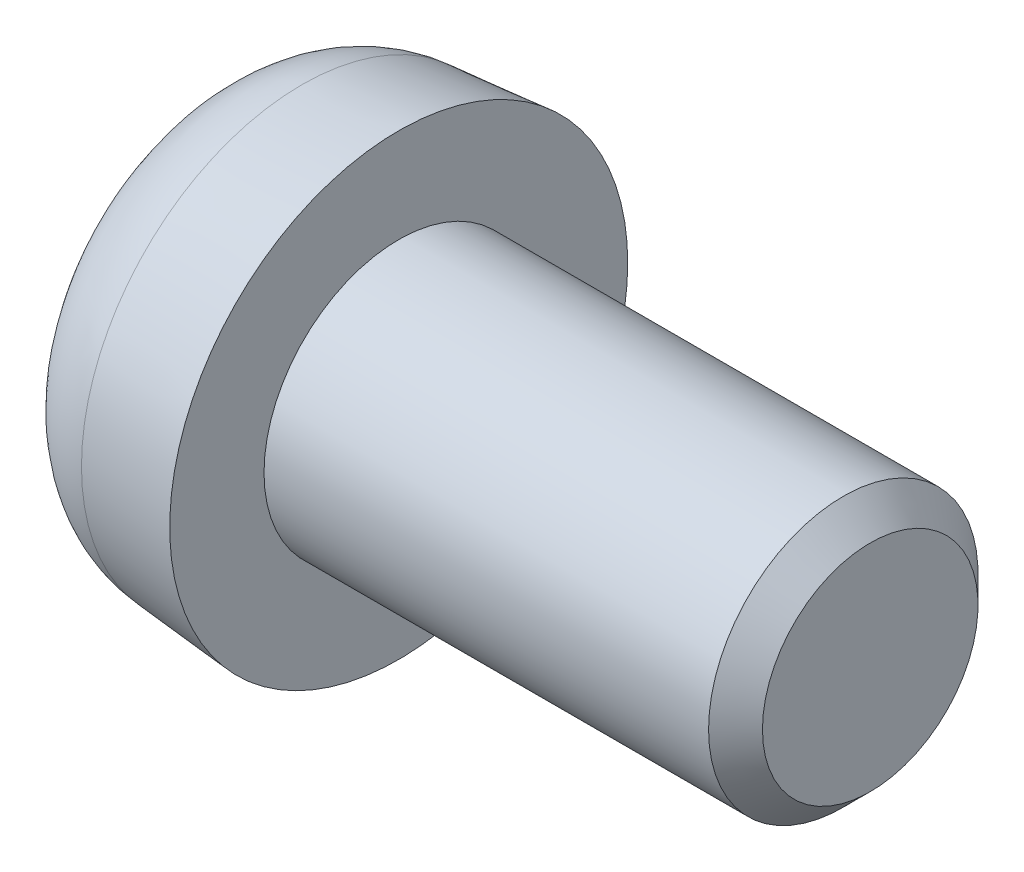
ISO-10303-21;
HEADER;
FILE_DESCRIPTION(('STEP AP214'),'2;1');
FILE_NAME('part.step','',(''),(''),'','','');
FILE_SCHEMA(('AUTOMOTIVE_DESIGN { 1 0 10303 214 1 1 1 1 }'));
ENDSEC;
DATA;
#1=APPLICATION_CONTEXT('core data for automotive mechanical design processes');
#2=APPLICATION_PROTOCOL_DEFINITION('international standard','automotive_design',2000,#1);
#3=PRODUCT_CONTEXT('',#1,'mechanical');
#4=PRODUCT('Part','Part','',(#3));
#5=PRODUCT_RELATED_PRODUCT_CATEGORY('part','',(#4));
#6=PRODUCT_DEFINITION_FORMATION('','',#4);
#7=PRODUCT_DEFINITION_CONTEXT('part definition',#1,'design');
#8=PRODUCT_DEFINITION('design','',#6,#7);
#9=PRODUCT_DEFINITION_SHAPE('','',#8);
#10=(LENGTH_UNIT() NAMED_UNIT(*) SI_UNIT(.MILLI.,.METRE.));
#11=(NAMED_UNIT(*) PLANE_ANGLE_UNIT() SI_UNIT($,.RADIAN.));
#12=(NAMED_UNIT(*) SI_UNIT($,.STERADIAN.) SOLID_ANGLE_UNIT());
#13=UNCERTAINTY_MEASURE_WITH_UNIT(LENGTH_MEASURE(1.E-05),#10,'distance_accuracy_value','');
#14=(GEOMETRIC_REPRESENTATION_CONTEXT(3) GLOBAL_UNCERTAINTY_ASSIGNED_CONTEXT((#13)) GLOBAL_UNIT_ASSIGNED_CONTEXT((#10,
#11,#12)) REPRESENTATION_CONTEXT('',''));
#15=CARTESIAN_POINT('',(0.,0.,0.));
#16=DIRECTION('',(0.,0.,1.));
#17=DIRECTION('',(1.,0.,0.));
#18=AXIS2_PLACEMENT_3D('',#15,#16,#17);
#19=CARTESIAN_POINT('',(10.3132026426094,0.,0.));
#20=DIRECTION('',(-1.,0.,0.));
#21=DIRECTION('',(0.,0.,1.));
#22=AXIS2_PLACEMENT_3D('',#19,#20,#21);
#23=CYLINDRICAL_SURFACE('',#22,1.);
#24=CARTESIAN_POINT('',(3.3,0.,0.));
#25=DIRECTION('',(1.,0.,0.));
#26=DIRECTION('',(0.,0.,-1.));
#27=AXIS2_PLACEMENT_3D('',#24,#25,#26);
#28=CIRCLE('',#27,1.);
#29=CARTESIAN_POINT('',(3.3,0.,1.));
#30=VERTEX_POINT('',#29);
#31=EDGE_CURVE('E41',#30,#30,#28,.F.);
#32=ORIENTED_EDGE('',*,*,#31,.T.);
#33=EDGE_LOOP('',(#32));
#34=FACE_BOUND('',#33,.T.);
#35=CARTESIAN_POINT('',(0.,0.,0.));
#36=DIRECTION('',(-1.,0.,0.));
#37=DIRECTION('',(0.,0.,1.));
#38=AXIS2_PLACEMENT_3D('',#35,#36,#37);
#39=CIRCLE('',#38,1.);
#40=CARTESIAN_POINT('',(0.,0.,1.));
#41=VERTEX_POINT('',#40);
#42=EDGE_CURVE('E189',#41,#41,#39,.F.);
#43=ORIENTED_EDGE('',*,*,#42,.T.);
#44=EDGE_LOOP('',(#43));
#45=FACE_BOUND('',#44,.T.);
#46=ADVANCED_FACE('F33',(#34,#45),#23,.T.);
#47=CARTESIAN_POINT('',(-0.257002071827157,0.2375,-0.2375));
#48=DIRECTION('',(0.795355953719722,0.,-0.606142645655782));
#49=DIRECTION('',(-0.606142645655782,0.,-0.795355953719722));
#50=AXIS2_PLACEMENT_3D('',#47,#48,#49);
#51=PLANE('',#50);
#52=DIRECTION('',(-0.606142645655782,0.,-0.795355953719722));
#53=VECTOR('',#52,1.);
#54=CARTESIAN_POINT('',(-0.257002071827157,0.2375,-0.2375));
#55=LINE('',#54,#53);
#56=CARTESIAN_POINT('',(-0.257002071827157,0.2375,-0.2375));
#57=VERTEX_POINT('',#56);
#58=CARTESIAN_POINT('',(-0.8,0.2375,-0.95));
#59=VERTEX_POINT('',#58);
#60=EDGE_CURVE('E279',#57,#59,#55,.T.);
#61=ORIENTED_EDGE('',*,*,#60,.T.);
#62=DIRECTION('',(0.,1.,0.));
#63=VECTOR('',#62,1.);
#64=CARTESIAN_POINT('',(-0.8,0.2375,-0.95));
#65=LINE('',#64,#63);
#66=CARTESIAN_POINT('',(-0.8,-0.2375,-0.95));
#67=VERTEX_POINT('',#66);
#68=EDGE_CURVE('E181',#59,#67,#65,.F.);
#69=ORIENTED_EDGE('',*,*,#68,.T.);
#70=DIRECTION('',(-0.606142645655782,0.,-0.795355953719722));
#71=VECTOR('',#70,1.);
#72=CARTESIAN_POINT('',(-0.257002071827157,-0.2375,-0.2375));
#73=LINE('',#72,#71);
#74=CARTESIAN_POINT('',(-0.257002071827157,-0.2375,-0.2375));
#75=VERTEX_POINT('',#74);
#76=EDGE_CURVE('E178',#75,#67,#73,.T.);
#77=ORIENTED_EDGE('',*,*,#76,.F.);
#78=DIRECTION('',(0.,1.,0.));
#79=VECTOR('',#78,1.);
#80=CARTESIAN_POINT('',(-0.257002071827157,0.,-0.2375));
#81=LINE('',#80,#79);
#82=EDGE_CURVE('E284',#57,#75,#81,.F.);
#83=ORIENTED_EDGE('',*,*,#82,.F.);
#84=EDGE_LOOP('',(#61,#69,#77,#83));
#85=FACE_BOUND('',#84,.T.);
#86=ADVANCED_FACE('F431',(#85),#51,.F.);
#87=CARTESIAN_POINT('',(-0.8,-0.95,0.2375));
#88=DIRECTION('',(0.792405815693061,-0.609994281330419,0.));
#89=DIRECTION('',(0.609994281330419,0.792405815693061,0.));
#90=AXIS2_PLACEMENT_3D('',#87,#88,#89);
#91=PLANE('',#90);
#92=DIRECTION('',(0.609994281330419,0.792405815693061,0.));
#93=VECTOR('',#92,1.);
#94=CARTESIAN_POINT('',(-0.8,-0.95,0.2375));
#95=LINE('',#94,#93);
#96=CARTESIAN_POINT('',(-0.8,-0.95,0.2375));
#97=VERTEX_POINT('',#96);
#98=CARTESIAN_POINT('',(-0.251517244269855,-0.2375,0.2375));
#99=VERTEX_POINT('',#98);
#100=EDGE_CURVE('E152',#97,#99,#95,.T.);
#101=ORIENTED_EDGE('',*,*,#100,.T.);
#102=DIRECTION('',(0.,0.,-1.));
#103=VECTOR('',#102,1.);
#104=CARTESIAN_POINT('',(-0.251517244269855,-0.2375,0.2375));
#105=LINE('',#104,#103);
#106=CARTESIAN_POINT('',(-0.251517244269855,-0.2375,-0.2375));
#107=VERTEX_POINT('',#106);
#108=EDGE_CURVE('E145',#99,#107,#105,.T.);
#109=ORIENTED_EDGE('',*,*,#108,.T.);
#110=DIRECTION('',(0.609994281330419,0.792405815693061,0.));
#111=VECTOR('',#110,1.);
#112=CARTESIAN_POINT('',(-0.8,-0.95,-0.2375));
#113=LINE('',#112,#111);
#114=CARTESIAN_POINT('',(-0.8,-0.95,-0.2375));
#115=VERTEX_POINT('',#114);
#116=EDGE_CURVE('E149',#115,#107,#113,.T.);
#117=ORIENTED_EDGE('',*,*,#116,.F.);
#118=DIRECTION('',(0.,0.,-1.));
#119=VECTOR('',#118,1.);
#120=CARTESIAN_POINT('',(-0.8,-0.95,0.2375));
#121=LINE('',#120,#119);
#122=EDGE_CURVE('E182',#115,#97,#121,.F.);
#123=ORIENTED_EDGE('',*,*,#122,.T.);
#124=EDGE_LOOP('',(#101,#109,#117,#123));
#125=FACE_BOUND('',#124,.T.);
#126=ADVANCED_FACE('F147',(#125),#91,.F.);
#127=CARTESIAN_POINT('',(-0.251517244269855,-0.2375,0.2375));
#128=DIRECTION('',(1.,0.,0.));
#129=DIRECTION('',(0.,0.,-1.));
#130=AXIS2_PLACEMENT_3D('',#127,#128,#129);
#131=PLANE('',#130);
#132=DIRECTION('',(0.,1.,0.));
#133=VECTOR('',#132,1.);
#134=CARTESIAN_POINT('',(-0.251517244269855,0.,0.2375));
#135=LINE('',#134,#133);
#136=CARTESIAN_POINT('',(-0.251517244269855,0.2375,0.2375));
#137=VERTEX_POINT('',#136);
#138=EDGE_CURVE('E258',#99,#137,#135,.T.);
#139=ORIENTED_EDGE('',*,*,#138,.T.);
#140=DIRECTION('',(0.,0.,1.));
#141=VECTOR('',#140,1.);
#142=CARTESIAN_POINT('',(-0.251517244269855,0.2375,0.2375));
#143=LINE('',#142,#141);
#144=CARTESIAN_POINT('',(-0.251517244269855,0.2375,-0.2375));
#145=VERTEX_POINT('',#144);
#146=EDGE_CURVE('E155',#137,#145,#143,.F.);
#147=ORIENTED_EDGE('',*,*,#146,.T.);
#148=DIRECTION('',(0.,1.,0.));
#149=VECTOR('',#148,1.);
#150=CARTESIAN_POINT('',(-0.251517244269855,0.,-0.2375));
#151=LINE('',#150,#149);
#152=EDGE_CURVE('E158',#107,#145,#151,.T.);
#153=ORIENTED_EDGE('',*,*,#152,.F.);
#154=ORIENTED_EDGE('',*,*,#108,.F.);
#155=EDGE_LOOP('',(#139,#147,#153,#154));
#156=FACE_BOUND('',#155,.T.);
#157=ADVANCED_FACE('F159',(#156),#131,.F.);
#158=CARTESIAN_POINT('',(-0.251517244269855,0.2375,0.2375));
#159=DIRECTION('',(0.792405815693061,0.609994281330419,0.));
#160=DIRECTION('',(-0.609994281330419,0.792405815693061,0.));
#161=AXIS2_PLACEMENT_3D('',#158,#159,#160);
#162=PLANE('',#161);
#163=DIRECTION('',(-0.609994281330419,0.792405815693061,0.));
#164=VECTOR('',#163,1.);
#165=CARTESIAN_POINT('',(-0.251517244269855,0.2375,0.2375));
#166=LINE('',#165,#164);
#167=CARTESIAN_POINT('',(-0.8,0.95,0.2375));
#168=VERTEX_POINT('',#167);
#169=EDGE_CURVE('E256',#137,#168,#166,.T.);
#170=ORIENTED_EDGE('',*,*,#169,.T.);
#171=DIRECTION('',(0.,0.,1.));
#172=VECTOR('',#171,1.);
#173=CARTESIAN_POINT('',(-0.8,0.95,0.2375));
#174=LINE('',#173,#172);
#175=CARTESIAN_POINT('',(-0.8,0.95,-0.2375));
#176=VERTEX_POINT('',#175);
#177=EDGE_CURVE('E250',#168,#176,#174,.F.);
#178=ORIENTED_EDGE('',*,*,#177,.T.);
#179=DIRECTION('',(-0.609994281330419,0.792405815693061,0.));
#180=VECTOR('',#179,1.);
#181=CARTESIAN_POINT('',(-0.251517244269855,0.2375,-0.2375));
#182=LINE('',#181,#180);
#183=EDGE_CURVE('E164',#145,#176,#182,.T.);
#184=ORIENTED_EDGE('',*,*,#183,.F.);
#185=ORIENTED_EDGE('',*,*,#146,.F.);
#186=EDGE_LOOP('',(#170,#178,#184,#185));
#187=FACE_BOUND('',#186,.T.);
#188=ADVANCED_FACE('F443',(#187),#162,.F.);
#189=CARTESIAN_POINT('',(-0.8,0.2375,0.95));
#190=DIRECTION('',(0.795355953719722,0.,0.606142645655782));
#191=DIRECTION('',(0.606142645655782,0.,-0.795355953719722));
#192=AXIS2_PLACEMENT_3D('',#189,#190,#191);
#193=PLANE('',#192);
#194=DIRECTION('',(0.606142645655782,0.,-0.795355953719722));
#195=VECTOR('',#194,1.);
#196=CARTESIAN_POINT('',(-0.8,0.2375,0.95));
#197=LINE('',#196,#195);
#198=CARTESIAN_POINT('',(-0.8,0.2375,0.95));
#199=VERTEX_POINT('',#198);
#200=CARTESIAN_POINT('',(-0.257002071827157,0.2375,0.2375));
#201=VERTEX_POINT('',#200);
#202=EDGE_CURVE('E231',#199,#201,#197,.T.);
#203=ORIENTED_EDGE('',*,*,#202,.T.);
#204=DIRECTION('',(0.,1.,0.));
#205=VECTOR('',#204,1.);
#206=CARTESIAN_POINT('',(-0.257002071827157,0.,0.2375));
#207=LINE('',#206,#205);
#208=CARTESIAN_POINT('',(-0.257002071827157,-0.2375,0.2375));
#209=VERTEX_POINT('',#208);
#210=EDGE_CURVE('E244',#201,#209,#207,.F.);
#211=ORIENTED_EDGE('',*,*,#210,.T.);
#212=DIRECTION('',(0.606142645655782,0.,-0.795355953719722));
#213=VECTOR('',#212,1.);
#214=CARTESIAN_POINT('',(-0.8,-0.2375,0.95));
#215=LINE('',#214,#213);
#216=CARTESIAN_POINT('',(-0.8,-0.2375,0.95));
#217=VERTEX_POINT('',#216);
#218=EDGE_CURVE('E240',#217,#209,#215,.T.);
#219=ORIENTED_EDGE('',*,*,#218,.F.);
#220=DIRECTION('',(0.,1.,0.));
#221=VECTOR('',#220,1.);
#222=CARTESIAN_POINT('',(-0.8,0.2375,0.95));
#223=LINE('',#222,#221);
#224=EDGE_CURVE('E102',#217,#199,#223,.T.);
#225=ORIENTED_EDGE('',*,*,#224,.T.);
#226=EDGE_LOOP('',(#203,#211,#219,#225));
#227=FACE_BOUND('',#226,.T.);
#228=ADVANCED_FACE('F381',(#227),#193,.F.);
#229=CARTESIAN_POINT('',(0.,-0.2375,0.));
#230=DIRECTION('',(0.,1.,0.));
#231=DIRECTION('',(0.,0.,1.));
#232=AXIS2_PLACEMENT_3D('',#229,#230,#231);
#233=PLANE('',#232);
#234=ORIENTED_EDGE('',*,*,#218,.T.);
#235=DIRECTION('',(1.,0.,0.));
#236=VECTOR('',#235,1.);
#237=CARTESIAN_POINT('',(0.,-0.2375,0.2375));
#238=LINE('',#237,#236);
#239=CARTESIAN_POINT('',(-1.58232422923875,-0.2375,0.2375));
#240=VERTEX_POINT('',#239);
#241=EDGE_CURVE('E86',#209,#240,#238,.F.);
#242=ORIENTED_EDGE('',*,*,#241,.T.);
#243=CARTESIAN_POINT('',(-1.44648875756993,-0.2375,0.950000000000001));
#244=CARTESIAN_POINT('',(-1.47856979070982,-0.237500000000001,0.847213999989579));
#245=CARTESIAN_POINT('',(-1.50540901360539,-0.237500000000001,0.742751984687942));
#246=CARTESIAN_POINT('',(-1.54828837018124,-0.237499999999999,0.532255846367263));
#247=CARTESIAN_POINT('',(-1.56438930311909,-0.237499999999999,0.426234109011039));
#248=CARTESIAN_POINT('',(-1.57787557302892,-0.237499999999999,0.292340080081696));
#249=CARTESIAN_POINT('',(-1.58027812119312,-0.237499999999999,0.264931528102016));
#250=CARTESIAN_POINT('',(-1.58232422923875,-0.2375,0.237499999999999));
#251=B_SPLINE_CURVE_WITH_KNOTS('',3,(#243,#244,#245,#246,#247,#248,#249,#250),.UNSPECIFIED.,.F.,
.F.,(4,2,2,4),(0.,0.322970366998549,0.644096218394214,0.726627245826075),.UNSPECIFIED.);
#252=CARTESIAN_POINT('',(-1.44648875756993,-0.2375,0.950000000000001));
#253=VERTEX_POINT('',#252);
#254=EDGE_CURVE('E325',#253,#240,#251,.T.);
#255=ORIENTED_EDGE('',*,*,#254,.F.);
#256=DIRECTION('',(1.,0.,0.));
#257=VECTOR('',#256,1.);
#258=CARTESIAN_POINT('',(-1.68,-0.2375,0.95));
#259=LINE('',#258,#257);
#260=EDGE_CURVE('E233',#253,#217,#259,.T.);
#261=ORIENTED_EDGE('',*,*,#260,.T.);
#262=EDGE_LOOP('',(#234,#242,#255,#261));
#263=FACE_BOUND('',#262,.T.);
#264=ADVANCED_FACE('F328',(#263),#233,.T.);
#265=CARTESIAN_POINT('',(-1.76,-0.95,0.2375));
#266=DIRECTION('',(0.,-1.,0.));
#267=DIRECTION('',(0.,0.,-1.));
#268=AXIS2_PLACEMENT_3D('',#265,#266,#267);
#269=PLANE('',#268);
#270=ORIENTED_EDGE('',*,*,#122,.F.);
#271=DIRECTION('',(1.,0.,0.));
#272=VECTOR('',#271,1.);
#273=CARTESIAN_POINT('',(0.,-0.95,-0.2375));
#274=LINE('',#273,#272);
#275=CARTESIAN_POINT('',(-1.44648875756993,-0.950000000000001,-0.2375));
#276=VERTEX_POINT('',#275);
#277=EDGE_CURVE('E169',#276,#115,#274,.T.);
#278=ORIENTED_EDGE('',*,*,#277,.F.);
#279=CARTESIAN_POINT('',(-1.44648875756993,-0.95,0.2375));
#280=CARTESIAN_POINT('',(-1.45265113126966,-0.95,0.158333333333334));
#281=CARTESIAN_POINT('',(-1.45573231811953,-0.95,0.0791666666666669));
#282=CARTESIAN_POINT('',(-1.45573231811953,-0.95,-0.0791666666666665));
#283=CARTESIAN_POINT('',(-1.45265113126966,-0.95,-0.158333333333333));
#284=CARTESIAN_POINT('',(-1.44648875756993,-0.95,-0.2375));
#285=B_SPLINE_CURVE_WITH_KNOTS('',3,(#279,#280,#281,#282,#283,#284),.UNSPECIFIED.,.F.,.F.,(4,2,
4),(0.,0.237679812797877,0.475359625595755),.UNSPECIFIED.);
#286=CARTESIAN_POINT('',(-1.44648875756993,-0.95,0.2375));
#287=VERTEX_POINT('',#286);
#288=EDGE_CURVE('E367',#287,#276,#285,.T.);
#289=ORIENTED_EDGE('',*,*,#288,.F.);
#290=DIRECTION('',(1.,0.,0.));
#291=VECTOR('',#290,1.);
#292=CARTESIAN_POINT('',(0.,-0.95,0.2375));
#293=LINE('',#292,#291);
#294=EDGE_CURVE('E270',#287,#97,#293,.T.);
#295=ORIENTED_EDGE('',*,*,#294,.T.);
#296=EDGE_LOOP('',(#270,#278,#289,#295));
#297=FACE_BOUND('',#296,.T.);
#298=ADVANCED_FACE('F380',(#297),#269,.F.);
#299=CARTESIAN_POINT('',(0.,-0.2375,0.));
#300=DIRECTION('',(0.,1.,0.));
#301=DIRECTION('',(0.,0.,1.));
#302=AXIS2_PLACEMENT_3D('',#299,#300,#301);
#303=PLANE('',#302);
#304=CARTESIAN_POINT('',(-1.58232422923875,-0.2375,-0.237500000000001));
#305=CARTESIAN_POINT('',(-1.57433797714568,-0.2375,-0.344879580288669));
#306=CARTESIAN_POINT('',(-1.56086094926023,-0.2375,-0.451889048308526));
#307=CARTESIAN_POINT('',(-1.52328687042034,-0.2375,-0.66339661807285));
#308=CARTESIAN_POINT('',(-1.49925091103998,-0.2375,-0.767905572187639));
#309=CARTESIAN_POINT('',(-1.46252891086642,-0.2375,-0.897369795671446));
#310=CARTESIAN_POINT('',(-1.4546787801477,-0.2375,-0.923739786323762));
#311=CARTESIAN_POINT('',(-1.44648875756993,-0.2375,-0.950000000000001));
#312=B_SPLINE_CURVE_WITH_KNOTS('',3,(#304,#305,#306,#307,#308,#309,#310,#311),.UNSPECIFIED.,.F.,
.F.,(4,2,2,4),(0.,0.322970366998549,0.644096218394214,0.726627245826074),.UNSPECIFIED.);
#313=CARTESIAN_POINT('',(-1.58232422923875,-0.2375,-0.2375));
#314=VERTEX_POINT('',#313);
#315=CARTESIAN_POINT('',(-1.44648875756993,-0.2375,-0.95));
#316=VERTEX_POINT('',#315);
#317=EDGE_CURVE('E396',#314,#316,#312,.T.);
#318=ORIENTED_EDGE('',*,*,#317,.F.);
#319=DIRECTION('',(1.,0.,0.));
#320=VECTOR('',#319,1.);
#321=CARTESIAN_POINT('',(0.,-0.2375,-0.2375));
#322=LINE('',#321,#320);
#323=EDGE_CURVE('E171',#75,#314,#322,.F.);
#324=ORIENTED_EDGE('',*,*,#323,.F.);
#325=ORIENTED_EDGE('',*,*,#76,.T.);
#326=DIRECTION('',(-1.,0.,0.));
#327=VECTOR('',#326,1.);
#328=CARTESIAN_POINT('',(-0.8,-0.2375,-0.95));
#329=LINE('',#328,#327);
#330=EDGE_CURVE('E186',#67,#316,#329,.T.);
#331=ORIENTED_EDGE('',*,*,#330,.T.);
#332=EDGE_LOOP('',(#318,#324,#325,#331));
#333=FACE_BOUND('',#332,.T.);
#334=ADVANCED_FACE('F386',(#333),#303,.T.);
#335=CARTESIAN_POINT('',(-0.8,0.2375,-0.95));
#336=DIRECTION('',(0.,0.,-1.));
#337=DIRECTION('',(-1.,0.,0.));
#338=AXIS2_PLACEMENT_3D('',#335,#336,#337);
#339=PLANE('',#338);
#340=CARTESIAN_POINT('',(-1.44648875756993,-0.2375,-0.95));
#341=CARTESIAN_POINT('',(-1.45265113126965,-0.158333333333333,-0.95));
#342=CARTESIAN_POINT('',(-1.4557323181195,-0.0791666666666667,-0.950000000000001));
#343=CARTESIAN_POINT('',(-1.4557323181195,0.0791666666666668,-0.950000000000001));
#344=CARTESIAN_POINT('',(-1.45265113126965,0.158333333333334,-0.95));
#345=CARTESIAN_POINT('',(-1.44648875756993,0.2375,-0.95));
#346=B_SPLINE_CURVE_WITH_KNOTS('',3,(#340,#341,#342,#343,#344,#345),.UNSPECIFIED.,.F.,.F.,(4,2,
4),(0.,0.237679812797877,0.475359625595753),.UNSPECIFIED.);
#347=CARTESIAN_POINT('',(-1.44648875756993,0.2375,-0.950000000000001));
#348=VERTEX_POINT('',#347);
#349=EDGE_CURVE('E401',#316,#348,#346,.T.);
#350=ORIENTED_EDGE('',*,*,#349,.F.);
#351=ORIENTED_EDGE('',*,*,#330,.F.);
#352=ORIENTED_EDGE('',*,*,#68,.F.);
#353=DIRECTION('',(1.,0.,0.));
#354=VECTOR('',#353,1.);
#355=CARTESIAN_POINT('',(0.,0.2375,-0.95));
#356=LINE('',#355,#354);
#357=EDGE_CURVE('E281',#59,#348,#356,.F.);
#358=ORIENTED_EDGE('',*,*,#357,.T.);
#359=EDGE_LOOP('',(#350,#351,#352,#358));
#360=FACE_BOUND('',#359,.T.);
#361=ADVANCED_FACE('F391',(#360),#339,.F.);
#362=CARTESIAN_POINT('',(0.,0.2375,0.));
#363=DIRECTION('',(0.,1.,0.));
#364=DIRECTION('',(0.,0.,1.));
#365=AXIS2_PLACEMENT_3D('',#362,#363,#364);
#366=PLANE('',#365);
#367=ORIENTED_EDGE('',*,*,#357,.F.);
#368=ORIENTED_EDGE('',*,*,#60,.F.);
#369=DIRECTION('',(1.,0.,0.));
#370=VECTOR('',#369,1.);
#371=CARTESIAN_POINT('',(0.,0.2375,-0.2375));
#372=LINE('',#371,#370);
#373=CARTESIAN_POINT('',(-1.58232422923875,0.2375,-0.2375));
#374=VERTEX_POINT('',#373);
#375=EDGE_CURVE('E253',#374,#57,#372,.T.);
#376=ORIENTED_EDGE('',*,*,#375,.F.);
#377=CARTESIAN_POINT('',(-1.44648875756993,0.2375,-0.950000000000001));
#378=CARTESIAN_POINT('',(-1.47856979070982,0.237500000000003,-0.847213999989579));
#379=CARTESIAN_POINT('',(-1.50540901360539,0.237500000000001,-0.742751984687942));
#380=CARTESIAN_POINT('',(-1.54828837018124,0.237499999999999,-0.532255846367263));
#381=CARTESIAN_POINT('',(-1.56438930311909,0.237499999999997,-0.426234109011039));
#382=CARTESIAN_POINT('',(-1.57787557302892,0.237499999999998,-0.292340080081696));
#383=CARTESIAN_POINT('',(-1.58027812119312,0.237499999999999,-0.264931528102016));
#384=CARTESIAN_POINT('',(-1.58232422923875,0.237499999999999,-0.237499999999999));
#385=B_SPLINE_CURVE_WITH_KNOTS('',3,(#377,#378,#379,#380,#381,#382,#383,#384),.UNSPECIFIED.,.F.,
.F.,(4,2,2,4),(0.,0.322970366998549,0.644096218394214,0.726627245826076),.UNSPECIFIED.);
#386=EDGE_CURVE('E420',#348,#374,#385,.T.);
#387=ORIENTED_EDGE('',*,*,#386,.F.);
#388=EDGE_LOOP('',(#367,#368,#376,#387));
#389=FACE_BOUND('',#388,.T.);
#390=ADVANCED_FACE('F413',(#389),#366,.F.);
#391=CARTESIAN_POINT('',(0.,0.,-0.2375));
#392=DIRECTION('',(0.,0.,1.));
#393=DIRECTION('',(1.,0.,0.));
#394=AXIS2_PLACEMENT_3D('',#391,#392,#393);
#395=PLANE('',#394);
#396=CARTESIAN_POINT('',(-1.58232422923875,0.2375,-0.2375));
#397=CARTESIAN_POINT('',(-1.57433797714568,0.344879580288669,-0.2375));
#398=CARTESIAN_POINT('',(-1.56086094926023,0.451889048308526,-0.2375));
#399=CARTESIAN_POINT('',(-1.52328687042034,0.663396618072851,-0.2375));
#400=CARTESIAN_POINT('',(-1.49925091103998,0.767905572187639,-0.2375));
#401=CARTESIAN_POINT('',(-1.46252891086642,0.897369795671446,-0.2375));
#402=CARTESIAN_POINT('',(-1.4546787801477,0.923739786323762,-0.2375));
#403=CARTESIAN_POINT('',(-1.44648875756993,0.950000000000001,-0.2375));
#404=B_SPLINE_CURVE_WITH_KNOTS('',3,(#396,#397,#398,#399,#400,#401,#402,#403),.UNSPECIFIED.,.F.,
.F.,(4,2,2,4),(0.,0.322970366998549,0.644096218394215,0.726627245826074),.UNSPECIFIED.);
#405=CARTESIAN_POINT('',(-1.44648875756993,0.95,-0.2375));
#406=VERTEX_POINT('',#405);
#407=EDGE_CURVE('E338',#374,#406,#404,.T.);
#408=ORIENTED_EDGE('',*,*,#407,.F.);
#409=ORIENTED_EDGE('',*,*,#375,.T.);
#410=ORIENTED_EDGE('',*,*,#82,.T.);
#411=ORIENTED_EDGE('',*,*,#323,.T.);
#412=CARTESIAN_POINT('',(-1.44648875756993,-0.950000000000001,-0.2375));
#413=CARTESIAN_POINT('',(-1.47856979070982,-0.847213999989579,-0.237500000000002));
#414=CARTESIAN_POINT('',(-1.50540901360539,-0.742751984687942,-0.237500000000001));
#415=CARTESIAN_POINT('',(-1.54828837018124,-0.532255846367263,-0.237499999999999));
#416=CARTESIAN_POINT('',(-1.56438930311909,-0.426234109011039,-0.237499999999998));
#417=CARTESIAN_POINT('',(-1.57787557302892,-0.292340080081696,-0.237499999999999));
#418=CARTESIAN_POINT('',(-1.58027812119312,-0.264931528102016,-0.237499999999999));
#419=CARTESIAN_POINT('',(-1.58232422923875,-0.237499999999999,-0.2375));
#420=B_SPLINE_CURVE_WITH_KNOTS('',3,(#412,#413,#414,#415,#416,#417,#418,#419),.UNSPECIFIED.,.F.,
.F.,(4,2,2,4),(0.,0.322970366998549,0.644096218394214,0.726627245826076),.UNSPECIFIED.);
#421=EDGE_CURVE('E402',#276,#314,#420,.T.);
#422=ORIENTED_EDGE('',*,*,#421,.F.);
#423=ORIENTED_EDGE('',*,*,#277,.T.);
#424=ORIENTED_EDGE('',*,*,#116,.T.);
#425=ORIENTED_EDGE('',*,*,#152,.T.);
#426=ORIENTED_EDGE('',*,*,#183,.T.);
#427=DIRECTION('',(1.,0.,0.));
#428=VECTOR('',#427,1.);
#429=CARTESIAN_POINT('',(-0.8,0.95,-0.2375));
#430=LINE('',#429,#428);
#431=EDGE_CURVE('E252',#176,#406,#430,.F.);
#432=ORIENTED_EDGE('',*,*,#431,.T.);
#433=EDGE_LOOP('',(#408,#409,#410,#411,#422,#423,#424,#425,#426,#432));
#434=FACE_BOUND('',#433,.T.);
#435=ADVANCED_FACE('F167',(#434),#395,.T.);
#436=CARTESIAN_POINT('',(-0.8,0.95,0.2375));
#437=DIRECTION('',(0.,1.,0.));
#438=DIRECTION('',(0.,0.,1.));
#439=AXIS2_PLACEMENT_3D('',#436,#437,#438);
#440=PLANE('',#439);
#441=ORIENTED_EDGE('',*,*,#177,.F.);
#442=DIRECTION('',(1.,0.,0.));
#443=VECTOR('',#442,1.);
#444=CARTESIAN_POINT('',(0.,0.95,0.2375));
#445=LINE('',#444,#443);
#446=CARTESIAN_POINT('',(-1.44648875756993,0.950000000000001,0.2375));
#447=VERTEX_POINT('',#446);
#448=EDGE_CURVE('E247',#168,#447,#445,.F.);
#449=ORIENTED_EDGE('',*,*,#448,.T.);
#450=CARTESIAN_POINT('',(-1.44648875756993,0.95,-0.2375));
#451=CARTESIAN_POINT('',(-1.45265113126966,0.95,-0.158333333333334));
#452=CARTESIAN_POINT('',(-1.45573231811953,0.95,-0.0791666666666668));
#453=CARTESIAN_POINT('',(-1.45573231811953,0.95,0.0791666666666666));
#454=CARTESIAN_POINT('',(-1.45265113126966,0.95,0.158333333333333));
#455=CARTESIAN_POINT('',(-1.44648875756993,0.95,0.2375));
#456=B_SPLINE_CURVE_WITH_KNOTS('',3,(#450,#451,#452,#453,#454,#455),.UNSPECIFIED.,.F.,.F.,(4,2,
4),(0.,0.237679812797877,0.475359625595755),.UNSPECIFIED.);
#457=EDGE_CURVE('E337',#406,#447,#456,.T.);
#458=ORIENTED_EDGE('',*,*,#457,.F.);
#459=ORIENTED_EDGE('',*,*,#431,.F.);
#460=EDGE_LOOP('',(#441,#449,#458,#459));
#461=FACE_BOUND('',#460,.T.);
#462=ADVANCED_FACE('F353',(#461),#440,.F.);
#463=CARTESIAN_POINT('',(0.,0.,0.2375));
#464=DIRECTION('',(0.,0.,1.));
#465=DIRECTION('',(1.,0.,0.));
#466=AXIS2_PLACEMENT_3D('',#463,#464,#465);
#467=PLANE('',#466);
#468=DIRECTION('',(1.,0.,0.));
#469=VECTOR('',#468,1.);
#470=CARTESIAN_POINT('',(0.,0.2375,0.2375));
#471=LINE('',#470,#469);
#472=CARTESIAN_POINT('',(-1.58232422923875,0.2375,0.2375));
#473=VERTEX_POINT('',#472);
#474=EDGE_CURVE('E234',#201,#473,#471,.F.);
#475=ORIENTED_EDGE('',*,*,#474,.T.);
#476=CARTESIAN_POINT('',(-1.44648875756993,0.950000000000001,0.2375));
#477=CARTESIAN_POINT('',(-1.47856979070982,0.847213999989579,0.237500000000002));
#478=CARTESIAN_POINT('',(-1.50540901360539,0.742751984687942,0.237500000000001));
#479=CARTESIAN_POINT('',(-1.54828837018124,0.532255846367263,0.237499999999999));
#480=CARTESIAN_POINT('',(-1.56438930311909,0.426234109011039,0.237499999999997));
#481=CARTESIAN_POINT('',(-1.57787557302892,0.292340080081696,0.237499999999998));
#482=CARTESIAN_POINT('',(-1.58027812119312,0.264931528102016,0.237499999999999));
#483=CARTESIAN_POINT('',(-1.58232422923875,0.237499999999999,0.237499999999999));
#484=B_SPLINE_CURVE_WITH_KNOTS('',3,(#476,#477,#478,#479,#480,#481,#482,#483),.UNSPECIFIED.,.F.,
.F.,(4,2,2,4),(0.,0.322970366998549,0.644096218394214,0.726627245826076),.UNSPECIFIED.);
#485=EDGE_CURVE('E335',#447,#473,#484,.T.);
#486=ORIENTED_EDGE('',*,*,#485,.F.);
#487=ORIENTED_EDGE('',*,*,#448,.F.);
#488=ORIENTED_EDGE('',*,*,#169,.F.);
#489=ORIENTED_EDGE('',*,*,#138,.F.);
#490=ORIENTED_EDGE('',*,*,#100,.F.);
#491=ORIENTED_EDGE('',*,*,#294,.F.);
#492=CARTESIAN_POINT('',(-1.58232422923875,-0.2375,0.237500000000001));
#493=CARTESIAN_POINT('',(-1.57433797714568,-0.344879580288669,0.2375));
#494=CARTESIAN_POINT('',(-1.56086094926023,-0.451889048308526,0.2375));
#495=CARTESIAN_POINT('',(-1.52328687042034,-0.663396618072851,0.2375));
#496=CARTESIAN_POINT('',(-1.49925091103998,-0.767905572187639,0.2375));
#497=CARTESIAN_POINT('',(-1.46252891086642,-0.897369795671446,0.2375));
#498=CARTESIAN_POINT('',(-1.4546787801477,-0.923739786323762,0.2375));
#499=CARTESIAN_POINT('',(-1.44648875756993,-0.950000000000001,0.2375));
#500=B_SPLINE_CURVE_WITH_KNOTS('',3,(#492,#493,#494,#495,#496,#497,#498,#499),.UNSPECIFIED.,.F.,
.F.,(4,2,2,4),(0.,0.322970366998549,0.644096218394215,0.726627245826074),.UNSPECIFIED.);
#501=EDGE_CURVE('E360',#240,#287,#500,.T.);
#502=ORIENTED_EDGE('',*,*,#501,.F.);
#503=ORIENTED_EDGE('',*,*,#241,.F.);
#504=ORIENTED_EDGE('',*,*,#210,.F.);
#505=EDGE_LOOP('',(#475,#486,#487,#488,#489,#490,#491,#502,#503,#504));
#506=FACE_BOUND('',#505,.T.);
#507=ADVANCED_FACE('F349',(#506),#467,.F.);
#508=CARTESIAN_POINT('',(0.,0.2375,0.));
#509=DIRECTION('',(0.,1.,0.));
#510=DIRECTION('',(0.,0.,1.));
#511=AXIS2_PLACEMENT_3D('',#508,#509,#510);
#512=PLANE('',#511);
#513=DIRECTION('',(1.,0.,0.));
#514=VECTOR('',#513,1.);
#515=CARTESIAN_POINT('',(-1.68,0.2375,0.95));
#516=LINE('',#515,#514);
#517=CARTESIAN_POINT('',(-1.44648875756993,0.2375,0.95));
#518=VERTEX_POINT('',#517);
#519=EDGE_CURVE('E49',#199,#518,#516,.F.);
#520=ORIENTED_EDGE('',*,*,#519,.T.);
#521=CARTESIAN_POINT('',(-1.58232422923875,0.2375,0.2375));
#522=CARTESIAN_POINT('',(-1.57433797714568,0.2375,0.344879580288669));
#523=CARTESIAN_POINT('',(-1.56086094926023,0.2375,0.451889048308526));
#524=CARTESIAN_POINT('',(-1.52328687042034,0.2375,0.663396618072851));
#525=CARTESIAN_POINT('',(-1.49925091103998,0.2375,0.767905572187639));
#526=CARTESIAN_POINT('',(-1.46252891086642,0.2375,0.897369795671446));
#527=CARTESIAN_POINT('',(-1.4546787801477,0.2375,0.923739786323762));
#528=CARTESIAN_POINT('',(-1.44648875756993,0.2375,0.950000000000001));
#529=B_SPLINE_CURVE_WITH_KNOTS('',3,(#521,#522,#523,#524,#525,#526,#527,#528),.UNSPECIFIED.,.F.,
.F.,(4,2,2,4),(0.,0.322970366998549,0.644096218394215,0.726627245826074),.UNSPECIFIED.);
#530=EDGE_CURVE('E203',#473,#518,#529,.T.);
#531=ORIENTED_EDGE('',*,*,#530,.F.);
#532=ORIENTED_EDGE('',*,*,#474,.F.);
#533=ORIENTED_EDGE('',*,*,#202,.F.);
#534=EDGE_LOOP('',(#520,#531,#532,#533));
#535=FACE_BOUND('',#534,.T.);
#536=ADVANCED_FACE('F352',(#535),#512,.F.);
#537=CARTESIAN_POINT('',(-1.68,0.2375,0.95));
#538=DIRECTION('',(0.,0.,1.));
#539=DIRECTION('',(1.,0.,0.));
#540=AXIS2_PLACEMENT_3D('',#537,#538,#539);
#541=PLANE('',#540);
#542=CARTESIAN_POINT('',(-1.44648875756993,0.237500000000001,0.95));
#543=CARTESIAN_POINT('',(-1.45265113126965,0.158333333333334,0.949999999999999));
#544=CARTESIAN_POINT('',(-1.4557323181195,0.0791666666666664,0.949999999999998));
#545=CARTESIAN_POINT('',(-1.4557323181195,-0.0791666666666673,0.949999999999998));
#546=CARTESIAN_POINT('',(-1.45265113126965,-0.158333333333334,0.949999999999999));
#547=CARTESIAN_POINT('',(-1.44648875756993,-0.2375,0.95));
#548=B_SPLINE_CURVE_WITH_KNOTS('',3,(#542,#543,#544,#545,#546,#547),.UNSPECIFIED.,.F.,.F.,(4,2,
4),(0.,0.237679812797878,0.475359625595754),.UNSPECIFIED.);
#549=EDGE_CURVE('E93',#518,#253,#548,.T.);
#550=ORIENTED_EDGE('',*,*,#549,.F.);
#551=ORIENTED_EDGE('',*,*,#519,.F.);
#552=ORIENTED_EDGE('',*,*,#224,.F.);
#553=ORIENTED_EDGE('',*,*,#260,.F.);
#554=EDGE_LOOP('',(#550,#551,#552,#553));
#555=FACE_BOUND('',#554,.T.);
#556=ADVANCED_FACE('F209',(#555),#541,.F.);
#557=CARTESIAN_POINT('',(1.6,0.,0.));
#558=DIRECTION('',(1.,0.,0.));
#559=DIRECTION('',(0.,0.,-1.));
#560=AXIS2_PLACEMENT_3D('',#557,#558,#559);
#561=SPHERICAL_SURFACE('',#560,3.2);
#562=ORIENTED_EDGE('',*,*,#317,.T.);
#563=ORIENTED_EDGE('',*,*,#349,.T.);
#564=ORIENTED_EDGE('',*,*,#386,.T.);
#565=ORIENTED_EDGE('',*,*,#407,.T.);
#566=ORIENTED_EDGE('',*,*,#457,.T.);
#567=ORIENTED_EDGE('',*,*,#485,.T.);
#568=ORIENTED_EDGE('',*,*,#530,.T.);
#569=ORIENTED_EDGE('',*,*,#549,.T.);
#570=ORIENTED_EDGE('',*,*,#254,.T.);
#571=ORIENTED_EDGE('',*,*,#501,.T.);
#572=ORIENTED_EDGE('',*,*,#288,.T.);
#573=ORIENTED_EDGE('',*,*,#421,.T.);
#574=EDGE_LOOP('',(#562,#563,#564,#565,#566,#567,#568,#569,#570,#571,#572,#573));
#575=FACE_BOUND('',#574,.T.);
#576=CARTESIAN_POINT('',(-1.39747848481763,0.,0.));
#577=DIRECTION('',(1.,0.,0.));
#578=DIRECTION('',(0.,0.,-1.));
#579=AXIS2_PLACEMENT_3D('',#576,#577,#578);
#580=CIRCLE('',#579,1.12032260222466);
#581=CARTESIAN_POINT('',(-1.39747848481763,0.,-1.12032260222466));
#582=VERTEX_POINT('',#581);
#583=EDGE_CURVE('E202',#582,#582,#580,.T.);
#584=ORIENTED_EDGE('',*,*,#583,.F.);
#585=EDGE_LOOP('',(#584));
#586=FACE_BOUND('',#585,.T.);
#587=ADVANCED_FACE('F211',(#575,#586),#561,.T.);
#588=CARTESIAN_POINT('',(-0.648108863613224,0.,0.));
#589=DIRECTION('',(1.,0.,0.));
#590=DIRECTION('',(0.,0.,-1.));
#591=AXIS2_PLACEMENT_3D('',#588,#589,#590);
#592=TOROIDAL_SURFACE('',#591,0.840241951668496,0.8);
#593=CARTESIAN_POINT('',(-0.717833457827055,0.,0.));
#594=DIRECTION('',(1.,0.,0.));
#595=DIRECTION('',(0.,0.,-1.));
#596=AXIS2_PLACEMENT_3D('',#593,#594,#595);
#597=CIRCLE('',#596,1.63719771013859);
#598=CARTESIAN_POINT('',(-0.717833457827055,0.,-1.63719771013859));
#599=VERTEX_POINT('',#598);
#600=EDGE_CURVE('E195',#599,#599,#597,.T.);
#601=ORIENTED_EDGE('',*,*,#600,.F.);
#602=EDGE_LOOP('',(#601));
#603=FACE_BOUND('',#602,.T.);
#604=ORIENTED_EDGE('',*,*,#583,.T.);
#605=EDGE_LOOP('',(#604));
#606=FACE_BOUND('',#605,.T.);
#607=ADVANCED_FACE('F216',(#603,#606),#592,.T.);
#608=CARTESIAN_POINT('',(-1.70530256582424E-10,0.,0.));
#609=DIRECTION('',(1.,0.,0.));
#610=DIRECTION('',(0.,0.,-1.));
#611=AXIS2_PLACEMENT_3D('',#608,#609,#610);
#612=CONICAL_SURFACE('',#611,1.69999999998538,0.0872664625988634);
#613=CARTESIAN_POINT('',(0.,0.,0.));
#614=DIRECTION('',(1.,0.,0.));
#615=DIRECTION('',(0.,0.,-1.));
#616=AXIS2_PLACEMENT_3D('',#613,#614,#615);
#617=CIRCLE('',#616,1.7000000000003);
#618=CARTESIAN_POINT('',(0.,0.,-1.7000000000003));
#619=VERTEX_POINT('',#618);
#620=EDGE_CURVE('E192',#619,#619,#617,.T.);
#621=ORIENTED_EDGE('',*,*,#620,.F.);
#622=EDGE_LOOP('',(#621));
#623=FACE_BOUND('',#622,.T.);
#624=ORIENTED_EDGE('',*,*,#600,.T.);
#625=EDGE_LOOP('',(#624));
#626=FACE_BOUND('',#625,.T.);
#627=ADVANCED_FACE('F461',(#623,#626),#612,.T.);
#628=CARTESIAN_POINT('',(0.,0.,-1.488625));
#629=DIRECTION('',(1.,0.,0.));
#630=DIRECTION('',(0.,0.,-1.));
#631=AXIS2_PLACEMENT_3D('',#628,#629,#630);
#632=PLANE('',#631);
#633=ORIENTED_EDGE('',*,*,#42,.F.);
#634=EDGE_LOOP('',(#633));
#635=FACE_BOUND('',#634,.T.);
#636=ORIENTED_EDGE('',*,*,#620,.T.);
#637=EDGE_LOOP('',(#636));
#638=FACE_BOUND('',#637,.T.);
#639=ADVANCED_FACE('F452',(#635,#638),#632,.T.);
#640=CARTESIAN_POINT('',(3.5,0.,-1.488625));
#641=DIRECTION('',(1.,0.,0.));
#642=DIRECTION('',(0.,0.,-1.));
#643=AXIS2_PLACEMENT_3D('',#640,#641,#642);
#644=PLANE('',#643);
#645=CARTESIAN_POINT('',(3.5,0.,0.));
#646=DIRECTION('',(1.,0.,0.));
#647=DIRECTION('',(0.,0.,-1.));
#648=AXIS2_PLACEMENT_3D('',#645,#646,#647);
#649=CIRCLE('',#648,0.799999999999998);
#650=CARTESIAN_POINT('',(3.5,0.,0.799999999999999));
#651=VERTEX_POINT('',#650);
#652=EDGE_CURVE('E12',#651,#651,#649,.T.);
#653=ORIENTED_EDGE('',*,*,#652,.T.);
#654=EDGE_LOOP('',(#653));
#655=FACE_BOUND('',#654,.T.);
#656=ADVANCED_FACE('F457',(#655),#644,.T.);
#657=CARTESIAN_POINT('',(3.3,0.,0.));
#658=DIRECTION('',(-1.,0.,0.));
#659=DIRECTION('',(0.,0.,1.));
#660=AXIS2_PLACEMENT_3D('',#657,#658,#659);
#661=CONICAL_SURFACE('',#660,1.,0.785398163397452);
#662=CARTESIAN_POINT('',(3.5,0.,0.799999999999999));
#663=CARTESIAN_POINT('',(3.49791666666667,0.,0.802083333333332));
#664=CARTESIAN_POINT('',(3.49583333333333,0.,0.804166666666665));
#665=CARTESIAN_POINT('',(3.49166666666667,0.,0.808333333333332));
#666=CARTESIAN_POINT('',(3.48958333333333,0.,0.810416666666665));
#667=CARTESIAN_POINT('',(3.48541666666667,0.,0.814583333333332));
#668=CARTESIAN_POINT('',(3.48333333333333,0.,0.816666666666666));
#669=CARTESIAN_POINT('',(3.47916666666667,0.,0.820833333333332));
#670=CARTESIAN_POINT('',(3.47708333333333,0.,0.822916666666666));
#671=CARTESIAN_POINT('',(3.47291666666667,0.,0.827083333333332));
#672=CARTESIAN_POINT('',(3.47083333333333,0.,0.829166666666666));
#673=CARTESIAN_POINT('',(3.46666666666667,0.,0.833333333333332));
#674=CARTESIAN_POINT('',(3.46458333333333,0.,0.835416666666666));
#675=CARTESIAN_POINT('',(3.46041666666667,0.,0.839583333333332));
#676=CARTESIAN_POINT('',(3.45833333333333,0.,0.841666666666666));
#677=CARTESIAN_POINT('',(3.45416666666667,0.,0.845833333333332));
#678=CARTESIAN_POINT('',(3.45208333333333,0.,0.847916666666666));
#679=CARTESIAN_POINT('',(3.44791666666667,0.,0.852083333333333));
#680=CARTESIAN_POINT('',(3.44583333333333,0.,0.854166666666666));
#681=CARTESIAN_POINT('',(3.44166666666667,0.,0.858333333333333));
#682=CARTESIAN_POINT('',(3.43958333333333,0.,0.860416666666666));
#683=CARTESIAN_POINT('',(3.43541666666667,0.,0.864583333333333));
#684=CARTESIAN_POINT('',(3.43333333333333,0.,0.866666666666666));
#685=CARTESIAN_POINT('',(3.42916666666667,0.,0.870833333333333));
#686=CARTESIAN_POINT('',(3.42708333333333,0.,0.872916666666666));
#687=CARTESIAN_POINT('',(3.42291666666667,0.,0.877083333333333));
#688=CARTESIAN_POINT('',(3.42083333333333,0.,0.879166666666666));
#689=CARTESIAN_POINT('',(3.41666666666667,0.,0.883333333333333));
#690=CARTESIAN_POINT('',(3.41458333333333,0.,0.885416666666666));
#691=CARTESIAN_POINT('',(3.41041666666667,0.,0.889583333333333));
#692=CARTESIAN_POINT('',(3.40833333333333,0.,0.891666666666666));
#693=CARTESIAN_POINT('',(3.40416666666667,0.,0.895833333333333));
#694=CARTESIAN_POINT('',(3.40208333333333,0.,0.897916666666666));
#695=CARTESIAN_POINT('',(3.39791666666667,0.,0.902083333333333));
#696=CARTESIAN_POINT('',(3.39583333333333,0.,0.904166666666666));
#697=CARTESIAN_POINT('',(3.39166666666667,0.,0.908333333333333));
#698=CARTESIAN_POINT('',(3.38958333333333,0.,0.910416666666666));
#699=CARTESIAN_POINT('',(3.38541666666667,0.,0.914583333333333));
#700=CARTESIAN_POINT('',(3.38333333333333,0.,0.916666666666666));
#701=CARTESIAN_POINT('',(3.37916666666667,0.,0.920833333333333));
#702=CARTESIAN_POINT('',(3.37708333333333,0.,0.922916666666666));
#703=CARTESIAN_POINT('',(3.37291666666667,0.,0.927083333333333));
#704=CARTESIAN_POINT('',(3.37083333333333,0.,0.929166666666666));
#705=CARTESIAN_POINT('',(3.36666666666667,0.,0.933333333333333));
#706=CARTESIAN_POINT('',(3.36458333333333,0.,0.935416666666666));
#707=CARTESIAN_POINT('',(3.36041666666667,0.,0.939583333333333));
#708=CARTESIAN_POINT('',(3.35833333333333,0.,0.941666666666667));
#709=CARTESIAN_POINT('',(3.35416666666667,0.,0.945833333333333));
#710=CARTESIAN_POINT('',(3.35208333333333,0.,0.947916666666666));
#711=CARTESIAN_POINT('',(3.34791666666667,0.,0.952083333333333));
#712=CARTESIAN_POINT('',(3.34583333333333,0.,0.954166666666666));
#713=CARTESIAN_POINT('',(3.34166666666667,0.,0.958333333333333));
#714=CARTESIAN_POINT('',(3.33958333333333,0.,0.960416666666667));
#715=CARTESIAN_POINT('',(3.33541666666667,0.,0.964583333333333));
#716=CARTESIAN_POINT('',(3.33333333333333,0.,0.966666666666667));
#717=CARTESIAN_POINT('',(3.32916666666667,0.,0.970833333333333));
#718=CARTESIAN_POINT('',(3.32708333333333,0.,0.972916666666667));
#719=CARTESIAN_POINT('',(3.32291666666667,0.,0.977083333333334));
#720=CARTESIAN_POINT('',(3.32083333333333,0.,0.979166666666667));
#721=CARTESIAN_POINT('',(3.31666666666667,0.,0.983333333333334));
#722=CARTESIAN_POINT('',(3.31458333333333,0.,0.985416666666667));
#723=CARTESIAN_POINT('',(3.31041666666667,0.,0.989583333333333));
#724=CARTESIAN_POINT('',(3.30833333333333,0.,0.991666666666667));
#725=CARTESIAN_POINT('',(3.30416666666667,0.,0.995833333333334));
#726=CARTESIAN_POINT('',(3.30208333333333,0.,0.997916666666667));
#727=CARTESIAN_POINT('',(3.3,0.,1.));
#728=B_SPLINE_CURVE_WITH_KNOTS('',3,(#662,#663,#664,#665,#666,#667,#668,#669,#670,#671,#672,
#673,#674,#675,#676,#677,#678,#679,#680,#681,#682,#683,#684,#685,#686,#687,#688,#689,#690,#691,
#692,#693,#694,#695,#696,#697,#698,#699,#700,#701,#702,#703,#704,#705,#706,#707,#708,#709,#710,
#711,#712,#713,#714,#715,#716,#717,#718,#719,#720,#721,#722,#723,#724,#725,#726,#727),
.UNSPECIFIED.,.F.,.F.,(4,2,2,2,2,2,2,2,2,2,2,2,2,2,2,2,2,2,2,2,2,2,2,2,2,2,2,2,2,2,2,2,4),(0.,
0.00883883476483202,0.017677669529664,0.0265165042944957,0.0353553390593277,0.0441941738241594,
0.0530330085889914,0.0618718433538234,0.0707106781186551,0.0795495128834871,0.0883883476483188,
0.0972271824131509,0.106066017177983,0.114904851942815,0.123743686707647,0.132582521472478,
0.14142135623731,0.150260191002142,0.159099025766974,0.167937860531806,0.176776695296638,
0.18561553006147,0.194454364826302,0.203293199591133,0.212132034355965,0.220970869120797,
0.229809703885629,0.238648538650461,0.247487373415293,0.256326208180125,0.265165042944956,
0.274003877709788,0.28284271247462),.UNSPECIFIED.);
#729=EDGE_CURVE('BSEAM467',#651,#30,#728,.T.);
#730=ORIENTED_EDGE('',*,*,#652,.F.);
#731=ORIENTED_EDGE('',*,*,#31,.F.);
#732=ORIENTED_EDGE('',*,*,#729,.T.);
#733=ORIENTED_EDGE('',*,*,#729,.F.);
#734=EDGE_LOOP('',(#730,#732,#731,#733));
#735=FACE_BOUND('',#734,.T.);
#736=ADVANCED_FACE('F467',(#735),#661,.T.);
#737=CLOSED_SHELL('',(#46,#86,#126,#157,#188,#228,#264,#298,#334,#361,#390,#435,#462,#507,#536,
#556,#587,#607,#627,#639,#656,#736));
#738=MANIFOLD_SOLID_BREP('B2',#737);
#739=ADVANCED_BREP_SHAPE_REPRESENTATION('',(#18,#738),#14);
#740=SHAPE_DEFINITION_REPRESENTATION(#9,#739);
ENDSEC;
END-ISO-10303-21;
